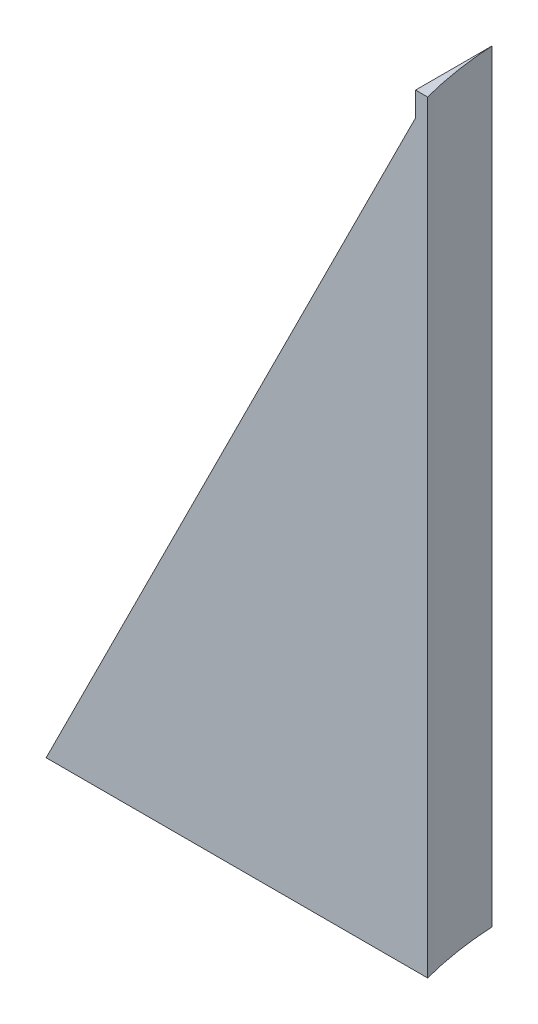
from build123d import *

# Parameters (mm, degrees)
BOSS_EXTRU_2_DEPTH      = 200
ENL_V_MAT_EXTRU_1_DEPTH = 200


with BuildPart() as part:
    # Esquisse1 → Boss.-Extru.2 (new body)
    with BuildSketch(Plane(origin=(0, 0, 0), x_dir=(1, 0, 0), z_dir=(0, 1, 0))):
        with BuildLine():
            Line((-69.220089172, -5.537386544), (-69.220089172, -25.537386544))
            Line((-69.220089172, -25.537386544), (30.779910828, -25.537386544))
            ThreePointArc((30.779910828, -25.537386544), (28.693278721, -15.617527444), (27.62164561, -5.537386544))
            Line((27.62164561, -5.537386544), (-69.220089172, -5.537386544))
        make_face()
    extrude(amount=BOSS_EXTRU_2_DEPTH)

    # Esquisse3 → Enl_v. mat.-Extru.1 (cut)
    with BuildSketch(Plane.XY.offset(25.537386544)):
        Polygon((-69.220089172, 0), (27.62164561, 193.683469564), (27.62164561, 200), (-69.220089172, 200), align=None)
    extrude(amount=-ENL_V_MAT_EXTRU_1_DEPTH, mode=Mode.SUBTRACT)


solid = part.part
